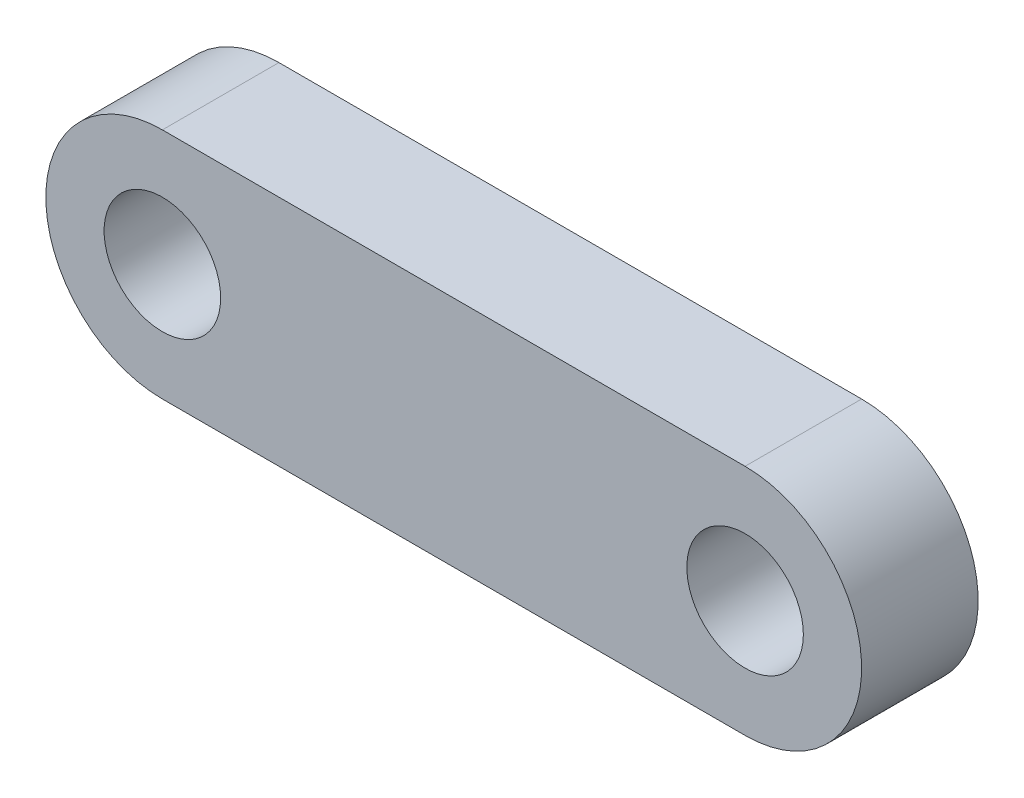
ISO-10303-21;
HEADER;
FILE_DESCRIPTION(('STEP AP214'),'2;1');
FILE_NAME('part.step','',(''),(''),'','','');
FILE_SCHEMA(('AUTOMOTIVE_DESIGN { 1 0 10303 214 1 1 1 1 }'));
ENDSEC;
DATA;
#1=APPLICATION_CONTEXT('core data for automotive mechanical design processes');
#2=APPLICATION_PROTOCOL_DEFINITION('international standard','automotive_design',2000,#1);
#3=PRODUCT_CONTEXT('',#1,'mechanical');
#4=PRODUCT('Part','Part','',(#3));
#5=PRODUCT_RELATED_PRODUCT_CATEGORY('part','',(#4));
#6=PRODUCT_DEFINITION_FORMATION('','',#4);
#7=PRODUCT_DEFINITION_CONTEXT('part definition',#1,'design');
#8=PRODUCT_DEFINITION('design','',#6,#7);
#9=PRODUCT_DEFINITION_SHAPE('','',#8);
#10=(LENGTH_UNIT() NAMED_UNIT(*) SI_UNIT(.MILLI.,.METRE.));
#11=(NAMED_UNIT(*) PLANE_ANGLE_UNIT() SI_UNIT($,.RADIAN.));
#12=(NAMED_UNIT(*) SI_UNIT($,.STERADIAN.) SOLID_ANGLE_UNIT());
#13=UNCERTAINTY_MEASURE_WITH_UNIT(LENGTH_MEASURE(1.E-05),#10,'distance_accuracy_value','');
#14=(GEOMETRIC_REPRESENTATION_CONTEXT(3) GLOBAL_UNCERTAINTY_ASSIGNED_CONTEXT((#13)) GLOBAL_UNIT_ASSIGNED_CONTEXT((#10,
#11,#12)) REPRESENTATION_CONTEXT('',''));
#15=CARTESIAN_POINT('',(0.,0.,0.));
#16=DIRECTION('',(0.,0.,1.));
#17=DIRECTION('',(1.,0.,0.));
#18=AXIS2_PLACEMENT_3D('',#15,#16,#17);
#19=CARTESIAN_POINT('',(0.,0.,5.));
#20=DIRECTION('',(0.,0.,1.));
#21=DIRECTION('',(1.,0.,0.));
#22=AXIS2_PLACEMENT_3D('',#19,#20,#21);
#23=PLANE('',#22);
#24=CARTESIAN_POINT('',(0.,0.,5.));
#25=DIRECTION('',(0.,0.,1.));
#26=DIRECTION('',(1.,0.,0.));
#27=AXIS2_PLACEMENT_3D('',#24,#25,#26);
#28=CIRCLE('',#27,5.);
#29=CARTESIAN_POINT('',(5.,0.,5.));
#30=VERTEX_POINT('',#29);
#31=EDGE_CURVE('E100',#30,#30,#28,.T.);
#32=ORIENTED_EDGE('',*,*,#31,.F.);
#33=EDGE_LOOP('',(#32));
#34=FACE_BOUND('',#33,.T.);
#35=CARTESIAN_POINT('',(0.,0.,5.));
#36=DIRECTION('',(0.,0.,1.));
#37=DIRECTION('',(1.,0.,0.));
#38=AXIS2_PLACEMENT_3D('',#35,#36,#37);
#39=CIRCLE('',#38,10.);
#40=CARTESIAN_POINT('',(0.,10.,5.));
#41=VERTEX_POINT('',#40);
#42=CARTESIAN_POINT('',(0.,-10.,5.));
#43=VERTEX_POINT('',#42);
#44=EDGE_CURVE('E85',#41,#43,#39,.T.);
#45=ORIENTED_EDGE('',*,*,#44,.T.);
#46=DIRECTION('',(1.,0.,0.));
#47=VECTOR('',#46,1.);
#48=CARTESIAN_POINT('',(0.,-10.,5.));
#49=LINE('',#48,#47);
#50=CARTESIAN_POINT('',(50.,-10.,5.));
#51=VERTEX_POINT('',#50);
#52=EDGE_CURVE('E80',#43,#51,#49,.T.);
#53=ORIENTED_EDGE('',*,*,#52,.T.);
#54=CARTESIAN_POINT('',(50.,0.,5.));
#55=DIRECTION('',(0.,0.,1.));
#56=DIRECTION('',(1.,0.,0.));
#57=AXIS2_PLACEMENT_3D('',#54,#55,#56);
#58=CIRCLE('',#57,10.);
#59=CARTESIAN_POINT('',(50.,10.,5.));
#60=VERTEX_POINT('',#59);
#61=EDGE_CURVE('E83',#51,#60,#58,.T.);
#62=ORIENTED_EDGE('',*,*,#61,.T.);
#63=DIRECTION('',(-1.,0.,0.));
#64=VECTOR('',#63,1.);
#65=CARTESIAN_POINT('',(0.,10.,5.));
#66=LINE('',#65,#64);
#67=EDGE_CURVE('E50',#60,#41,#66,.T.);
#68=ORIENTED_EDGE('',*,*,#67,.T.);
#69=EDGE_LOOP('',(#45,#53,#62,#68));
#70=FACE_BOUND('',#69,.T.);
#71=CARTESIAN_POINT('',(50.,0.,5.));
#72=DIRECTION('',(0.,0.,1.));
#73=DIRECTION('',(1.,0.,0.));
#74=AXIS2_PLACEMENT_3D('',#71,#72,#73);
#75=CIRCLE('',#74,5.);
#76=CARTESIAN_POINT('',(55.,0.,5.));
#77=VERTEX_POINT('',#76);
#78=EDGE_CURVE('E115',#77,#77,#75,.T.);
#79=ORIENTED_EDGE('',*,*,#78,.F.);
#80=EDGE_LOOP('',(#79));
#81=FACE_BOUND('',#80,.T.);
#82=ADVANCED_FACE('F33',(#34,#70,#81),#23,.T.);
#83=CARTESIAN_POINT('',(0.,0.,-5.));
#84=DIRECTION('',(0.,0.,1.));
#85=DIRECTION('',(1.,0.,0.));
#86=AXIS2_PLACEMENT_3D('',#83,#84,#85);
#87=PLANE('',#86);
#88=CARTESIAN_POINT('',(0.,0.,-5.));
#89=DIRECTION('',(0.,0.,1.));
#90=DIRECTION('',(1.,0.,0.));
#91=AXIS2_PLACEMENT_3D('',#88,#89,#90);
#92=CIRCLE('',#91,5.);
#93=CARTESIAN_POINT('',(5.,0.,-5.));
#94=VERTEX_POINT('',#93);
#95=EDGE_CURVE('E112',#94,#94,#92,.T.);
#96=ORIENTED_EDGE('',*,*,#95,.T.);
#97=EDGE_LOOP('',(#96));
#98=FACE_BOUND('',#97,.T.);
#99=CARTESIAN_POINT('',(0.,0.,-5.));
#100=DIRECTION('',(0.,0.,1.));
#101=DIRECTION('',(1.,0.,0.));
#102=AXIS2_PLACEMENT_3D('',#99,#100,#101);
#103=CIRCLE('',#102,10.);
#104=CARTESIAN_POINT('',(0.,10.,-5.));
#105=VERTEX_POINT('',#104);
#106=CARTESIAN_POINT('',(0.,-10.,-5.));
#107=VERTEX_POINT('',#106);
#108=EDGE_CURVE('E97',#105,#107,#103,.T.);
#109=ORIENTED_EDGE('',*,*,#108,.F.);
#110=DIRECTION('',(-1.,0.,0.));
#111=VECTOR('',#110,1.);
#112=CARTESIAN_POINT('',(0.,10.,-5.));
#113=LINE('',#112,#111);
#114=CARTESIAN_POINT('',(50.,10.,-5.));
#115=VERTEX_POINT('',#114);
#116=EDGE_CURVE('E73',#115,#105,#113,.T.);
#117=ORIENTED_EDGE('',*,*,#116,.F.);
#118=CARTESIAN_POINT('',(50.,0.,-5.));
#119=DIRECTION('',(0.,0.,1.));
#120=DIRECTION('',(1.,0.,0.));
#121=AXIS2_PLACEMENT_3D('',#118,#119,#120);
#122=CIRCLE('',#121,10.);
#123=CARTESIAN_POINT('',(50.,-10.,-5.));
#124=VERTEX_POINT('',#123);
#125=EDGE_CURVE('E67',#124,#115,#122,.T.);
#126=ORIENTED_EDGE('',*,*,#125,.F.);
#127=DIRECTION('',(1.,0.,0.));
#128=VECTOR('',#127,1.);
#129=CARTESIAN_POINT('',(0.,-10.,-5.));
#130=LINE('',#129,#128);
#131=EDGE_CURVE('E89',#107,#124,#130,.T.);
#132=ORIENTED_EDGE('',*,*,#131,.F.);
#133=EDGE_LOOP('',(#109,#117,#126,#132));
#134=FACE_BOUND('',#133,.T.);
#135=CARTESIAN_POINT('',(50.,0.,-5.));
#136=DIRECTION('',(0.,0.,1.));
#137=DIRECTION('',(1.,0.,0.));
#138=AXIS2_PLACEMENT_3D('',#135,#136,#137);
#139=CIRCLE('',#138,5.);
#140=CARTESIAN_POINT('',(55.,0.,-5.));
#141=VERTEX_POINT('',#140);
#142=EDGE_CURVE('E118',#141,#141,#139,.T.);
#143=ORIENTED_EDGE('',*,*,#142,.T.);
#144=EDGE_LOOP('',(#143));
#145=FACE_BOUND('',#144,.T.);
#146=ADVANCED_FACE('F108',(#98,#134,#145),#87,.F.);
#147=CARTESIAN_POINT('',(0.,0.,5.));
#148=DIRECTION('',(0.,0.,-1.));
#149=DIRECTION('',(-1.,0.,0.));
#150=AXIS2_PLACEMENT_3D('',#147,#148,#149);
#151=CYLINDRICAL_SURFACE('',#150,10.);
#152=ORIENTED_EDGE('',*,*,#108,.T.);
#153=DIRECTION('',(0.,0.,-1.));
#154=VECTOR('',#153,1.);
#155=CARTESIAN_POINT('',(0.,-10.,5.));
#156=LINE('',#155,#154);
#157=EDGE_CURVE('E11',#43,#107,#156,.T.);
#158=ORIENTED_EDGE('',*,*,#157,.F.);
#159=ORIENTED_EDGE('',*,*,#44,.F.);
#160=DIRECTION('',(0.,0.,-1.));
#161=VECTOR('',#160,1.);
#162=CARTESIAN_POINT('',(0.,10.,5.));
#163=LINE('',#162,#161);
#164=EDGE_CURVE('E93',#41,#105,#163,.T.);
#165=ORIENTED_EDGE('',*,*,#164,.T.);
#166=EDGE_LOOP('',(#152,#158,#159,#165));
#167=FACE_BOUND('',#166,.T.);
#168=ADVANCED_FACE('F35',(#167),#151,.T.);
#169=CARTESIAN_POINT('',(0.,-10.,5.));
#170=DIRECTION('',(0.,1.,0.));
#171=DIRECTION('',(0.,0.,1.));
#172=AXIS2_PLACEMENT_3D('',#169,#170,#171);
#173=PLANE('',#172);
#174=ORIENTED_EDGE('',*,*,#131,.T.);
#175=DIRECTION('',(0.,0.,-1.));
#176=VECTOR('',#175,1.);
#177=CARTESIAN_POINT('',(50.,-10.,5.));
#178=LINE('',#177,#176);
#179=EDGE_CURVE('E42',#51,#124,#178,.T.);
#180=ORIENTED_EDGE('',*,*,#179,.F.);
#181=ORIENTED_EDGE('',*,*,#52,.F.);
#182=ORIENTED_EDGE('',*,*,#157,.T.);
#183=EDGE_LOOP('',(#174,#180,#181,#182));
#184=FACE_BOUND('',#183,.T.);
#185=ADVANCED_FACE('F88',(#184),#173,.F.);
#186=CARTESIAN_POINT('',(50.,0.,5.));
#187=DIRECTION('',(0.,0.,-1.));
#188=DIRECTION('',(-1.,0.,0.));
#189=AXIS2_PLACEMENT_3D('',#186,#187,#188);
#190=CYLINDRICAL_SURFACE('',#189,10.);
#191=ORIENTED_EDGE('',*,*,#125,.T.);
#192=DIRECTION('',(0.,0.,-1.));
#193=VECTOR('',#192,1.);
#194=CARTESIAN_POINT('',(50.,10.,5.));
#195=LINE('',#194,#193);
#196=EDGE_CURVE('E90',#60,#115,#195,.T.);
#197=ORIENTED_EDGE('',*,*,#196,.F.);
#198=ORIENTED_EDGE('',*,*,#61,.F.);
#199=ORIENTED_EDGE('',*,*,#179,.T.);
#200=EDGE_LOOP('',(#191,#197,#198,#199));
#201=FACE_BOUND('',#200,.T.);
#202=ADVANCED_FACE('F91',(#201),#190,.T.);
#203=CARTESIAN_POINT('',(0.,10.,5.));
#204=DIRECTION('',(0.,-1.,0.));
#205=DIRECTION('',(0.,0.,-1.));
#206=AXIS2_PLACEMENT_3D('',#203,#204,#205);
#207=PLANE('',#206);
#208=ORIENTED_EDGE('',*,*,#116,.T.);
#209=ORIENTED_EDGE('',*,*,#164,.F.);
#210=ORIENTED_EDGE('',*,*,#67,.F.);
#211=ORIENTED_EDGE('',*,*,#196,.T.);
#212=EDGE_LOOP('',(#208,#209,#210,#211));
#213=FACE_BOUND('',#212,.T.);
#214=ADVANCED_FACE('F105',(#213),#207,.F.);
#215=CARTESIAN_POINT('',(0.,0.,5.));
#216=DIRECTION('',(0.,0.,-1.));
#217=DIRECTION('',(-1.,0.,0.));
#218=AXIS2_PLACEMENT_3D('',#215,#216,#217);
#219=CYLINDRICAL_SURFACE('',#218,5.);
#220=ORIENTED_EDGE('',*,*,#31,.T.);
#221=EDGE_LOOP('',(#220));
#222=FACE_BOUND('',#221,.T.);
#223=ORIENTED_EDGE('',*,*,#95,.F.);
#224=EDGE_LOOP('',(#223));
#225=FACE_BOUND('',#224,.T.);
#226=ADVANCED_FACE('F136',(#222,#225),#219,.F.);
#227=CARTESIAN_POINT('',(50.,0.,5.));
#228=DIRECTION('',(0.,0.,-1.));
#229=DIRECTION('',(-1.,0.,0.));
#230=AXIS2_PLACEMENT_3D('',#227,#228,#229);
#231=CYLINDRICAL_SURFACE('',#230,5.);
#232=ORIENTED_EDGE('',*,*,#78,.T.);
#233=EDGE_LOOP('',(#232));
#234=FACE_BOUND('',#233,.T.);
#235=ORIENTED_EDGE('',*,*,#142,.F.);
#236=EDGE_LOOP('',(#235));
#237=FACE_BOUND('',#236,.T.);
#238=ADVANCED_FACE('F124',(#234,#237),#231,.F.);
#239=CLOSED_SHELL('',(#82,#146,#168,#185,#202,#214,#226,#238));
#240=MANIFOLD_SOLID_BREP('B2',#239);
#241=ADVANCED_BREP_SHAPE_REPRESENTATION('',(#18,#240),#14);
#242=SHAPE_DEFINITION_REPRESENTATION(#9,#241);
ENDSEC;
END-ISO-10303-21;
